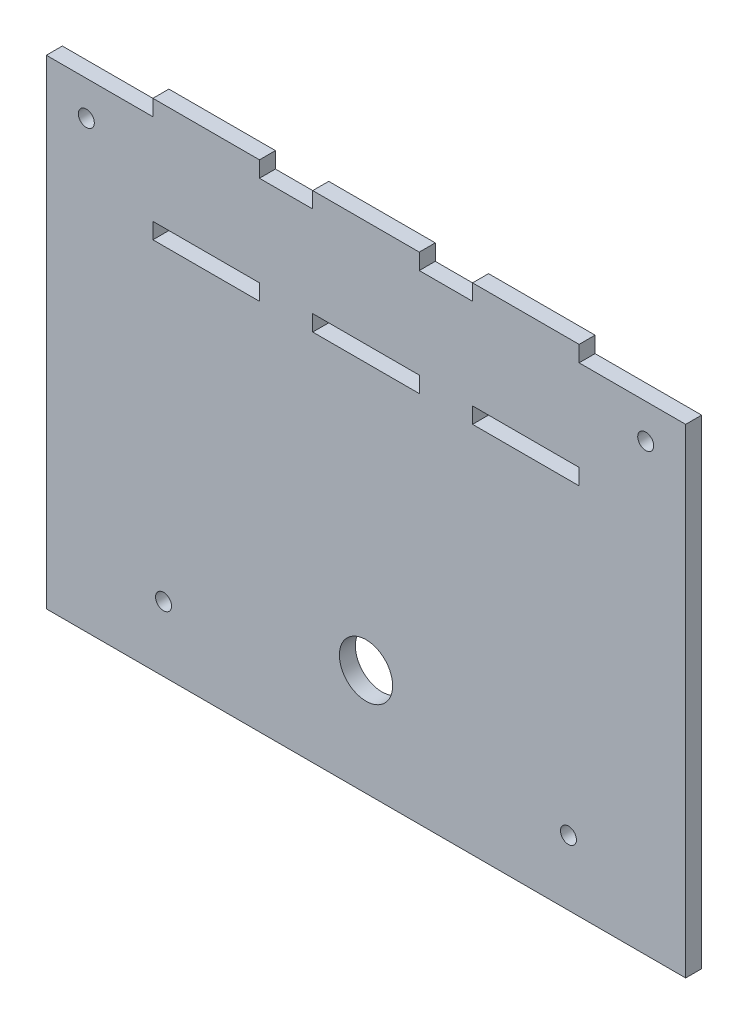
from build123d import *

# Parameters (mm, degrees)
ESQUISSE1_R        = 1.5
ESQUISSE1_W        = 20
ESQUISSE1_H        = 3
BOSS_EXTRU_1_DEPTH = 3


with BuildPart() as part:
    # Esquisse1 → Boss.-Extru.1 (new body)
    with BuildSketch(Plane.XY):
        Polygon((10, 0), (0, 0), (-10, 0), (-10, -3), (-20, -3), (-20, 0), (-40, 0), (-40, -3), (-60, -3), (-60, -93), (60, -93), (60, -3), (40, -3), (40, 0), (20, 0), (20, -3), (10, -3), align=None)
        with Locations((-38, -80.8)):
            Circle(ESQUISSE1_R, mode=Mode.SUBTRACT)
        with BuildLine():
            ThreePointArc((5, -73), (-3.535533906, -76.535533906), (0, -68))
            ThreePointArc((0, -68), (3.535533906, -69.464466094), (5, -73))
        make_face(mode=Mode.SUBTRACT)
        with Locations((38, -80.8)):
            Circle(ESQUISSE1_R, mode=Mode.SUBTRACT)
        with Locations((-30, -21.5)):
            Rectangle(ESQUISSE1_W, ESQUISSE1_H, mode=Mode.SUBTRACT)
        with Locations((-52.5, -9.5)):
            Circle(ESQUISSE1_R, mode=Mode.SUBTRACT)
        Polygon((-10, -20), (0, -20), (10, -20), (10, -23), (0, -23), (-10, -23), align=None, mode=Mode.SUBTRACT)
        with Locations((30, -21.5)):
            Rectangle(ESQUISSE1_W, ESQUISSE1_H, mode=Mode.SUBTRACT)
        with Locations((52.5, -9.5)):
            Circle(ESQUISSE1_R, mode=Mode.SUBTRACT)
    extrude(amount=BOSS_EXTRU_1_DEPTH)


solid = part.part
